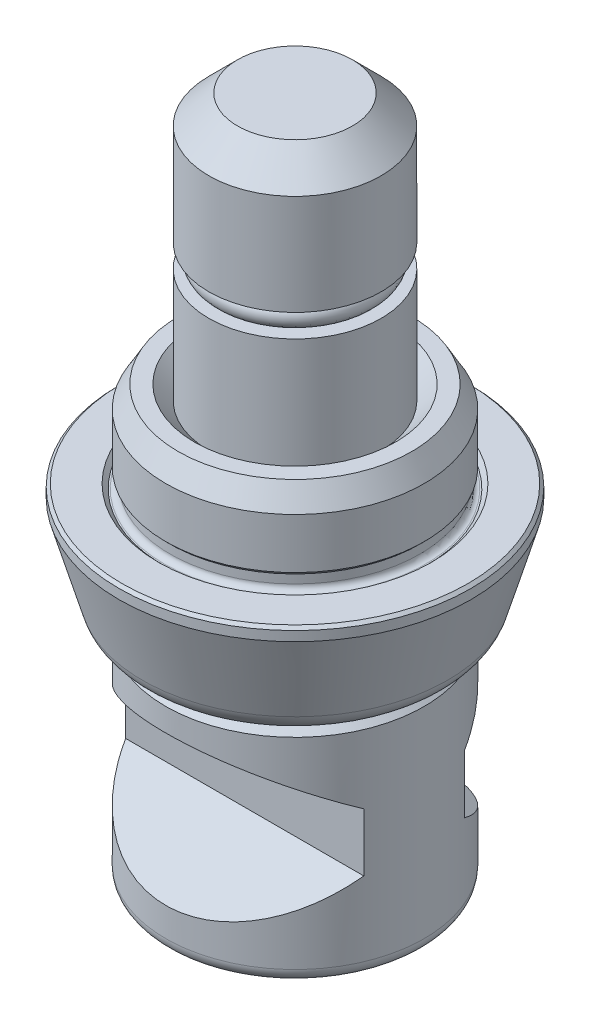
ISO-10303-21;
HEADER;
FILE_DESCRIPTION(('STEP AP214'),'2;1');
FILE_NAME('part.step','',(''),(''),'','','');
FILE_SCHEMA(('AUTOMOTIVE_DESIGN { 1 0 10303 214 1 1 1 1 }'));
ENDSEC;
DATA;
#1=APPLICATION_CONTEXT('core data for automotive mechanical design processes');
#2=APPLICATION_PROTOCOL_DEFINITION('international standard','automotive_design',2000,#1);
#3=PRODUCT_CONTEXT('',#1,'mechanical');
#4=PRODUCT('Part','Part','',(#3));
#5=PRODUCT_RELATED_PRODUCT_CATEGORY('part','',(#4));
#6=PRODUCT_DEFINITION_FORMATION('','',#4);
#7=PRODUCT_DEFINITION_CONTEXT('part definition',#1,'design');
#8=PRODUCT_DEFINITION('design','',#6,#7);
#9=PRODUCT_DEFINITION_SHAPE('','',#8);
#10=(LENGTH_UNIT() NAMED_UNIT(*) SI_UNIT(.MILLI.,.METRE.));
#11=(NAMED_UNIT(*) PLANE_ANGLE_UNIT() SI_UNIT($,.RADIAN.));
#12=(NAMED_UNIT(*) SI_UNIT($,.STERADIAN.) SOLID_ANGLE_UNIT());
#13=UNCERTAINTY_MEASURE_WITH_UNIT(LENGTH_MEASURE(1.E-05),#10,'distance_accuracy_value','');
#14=(GEOMETRIC_REPRESENTATION_CONTEXT(3) GLOBAL_UNCERTAINTY_ASSIGNED_CONTEXT((#13)) GLOBAL_UNIT_ASSIGNED_CONTEXT((#10,
#11,#12)) REPRESENTATION_CONTEXT('',''));
#15=CARTESIAN_POINT('',(0.,0.,0.));
#16=DIRECTION('',(0.,0.,1.));
#17=DIRECTION('',(1.,0.,0.));
#18=AXIS2_PLACEMENT_3D('',#15,#16,#17);
#19=CARTESIAN_POINT('',(-4.05,12.9625,0.));
#20=DIRECTION('',(0.,-1.,0.));
#21=DIRECTION('',(0.,0.,1.));
#22=AXIS2_PLACEMENT_3D('',#19,#20,#21);
#23=PLANE('',#22);
#24=CARTESIAN_POINT('',(0.,12.9625,0.));
#25=DIRECTION('',(0.,-1.,0.));
#26=DIRECTION('',(0.,0.,1.));
#27=AXIS2_PLACEMENT_3D('',#24,#25,#26);
#28=CIRCLE('',#27,6.);
#29=CARTESIAN_POINT('',(0.,12.9625,6.));
#30=VERTEX_POINT('',#29);
#31=EDGE_CURVE('E151',#30,#30,#28,.T.);
#32=ORIENTED_EDGE('',*,*,#31,.F.);
#33=EDGE_LOOP('',(#32));
#34=FACE_BOUND('',#33,.T.);
#35=CARTESIAN_POINT('',(0.,12.9625,0.));
#36=DIRECTION('',(0.,-1.,0.));
#37=DIRECTION('',(0.,0.,-1.));
#38=AXIS2_PLACEMENT_3D('',#35,#36,#37);
#39=CIRCLE('',#38,4.8);
#40=CARTESIAN_POINT('',(0.,12.9625,-4.8));
#41=VERTEX_POINT('',#40);
#42=EDGE_CURVE('E10',#41,#41,#39,.F.);
#43=ORIENTED_EDGE('',*,*,#42,.F.);
#44=EDGE_LOOP('',(#43));
#45=FACE_BOUND('',#44,.T.);
#46=ADVANCED_FACE('F16',(#34,#45),#23,.F.);
#47=CARTESIAN_POINT('',(0.,0.1,0.));
#48=DIRECTION('',(0.,-1.,0.));
#49=DIRECTION('',(0.,0.,-1.));
#50=AXIS2_PLACEMENT_3D('',#47,#48,#49);
#51=TOROIDAL_SURFACE('',#50,9.1,0.4);
#52=CARTESIAN_POINT('',(0.,0.1,0.));
#53=DIRECTION('',(0.,-1.,0.));
#54=DIRECTION('',(0.,0.,-1.));
#55=AXIS2_PLACEMENT_3D('',#52,#53,#54);
#56=CIRCLE('',#55,8.7);
#57=CARTESIAN_POINT('',(0.,0.1,-8.7));
#58=VERTEX_POINT('',#57);
#59=EDGE_CURVE('E661',#58,#58,#56,.F.);
#60=ORIENTED_EDGE('',*,*,#59,.F.);
#61=EDGE_LOOP('',(#60));
#62=FACE_BOUND('',#61,.T.);
#63=CARTESIAN_POINT('',(0.,-0.3,0.));
#64=DIRECTION('',(0.,-1.,0.));
#65=DIRECTION('',(0.,0.,-1.));
#66=AXIS2_PLACEMENT_3D('',#63,#64,#65);
#67=CIRCLE('',#66,9.1);
#68=CARTESIAN_POINT('',(0.,-0.3,-9.1));
#69=VERTEX_POINT('',#68);
#70=EDGE_CURVE('E658',#69,#69,#67,.T.);
#71=ORIENTED_EDGE('',*,*,#70,.F.);
#72=EDGE_LOOP('',(#71));
#73=FACE_BOUND('',#72,.T.);
#74=ADVANCED_FACE('F203',(#62,#73),#51,.F.);
#75=CARTESIAN_POINT('',(0.,1.,0.));
#76=DIRECTION('',(0.,1.,0.));
#77=DIRECTION('',(0.,0.,1.));
#78=AXIS2_PLACEMENT_3D('',#75,#76,#77);
#79=CONICAL_SURFACE('',#78,9.,0.78539816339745);
#80=CARTESIAN_POINT('',(0.,0.7,0.));
#81=DIRECTION('',(0.,-1.,0.));
#82=DIRECTION('',(0.,0.,-1.));
#83=AXIS2_PLACEMENT_3D('',#80,#81,#82);
#84=CIRCLE('',#83,8.7);
#85=CARTESIAN_POINT('',(0.,0.7,-8.7));
#86=VERTEX_POINT('',#85);
#87=EDGE_CURVE('E625',#86,#86,#84,.T.);
#88=ORIENTED_EDGE('',*,*,#87,.F.);
#89=EDGE_LOOP('',(#88));
#90=FACE_BOUND('',#89,.T.);
#91=CARTESIAN_POINT('',(0.,1.,0.));
#92=DIRECTION('',(0.,-1.,0.));
#93=DIRECTION('',(0.,0.,-1.));
#94=AXIS2_PLACEMENT_3D('',#91,#92,#93);
#95=CIRCLE('',#94,9.);
#96=CARTESIAN_POINT('',(0.,1.,-9.));
#97=VERTEX_POINT('',#96);
#98=EDGE_CURVE('E622',#97,#97,#95,.T.);
#99=ORIENTED_EDGE('',*,*,#98,.T.);
#100=EDGE_LOOP('',(#99));
#101=FACE_BOUND('',#100,.T.);
#102=ADVANCED_FACE('F270',(#90,#101),#79,.T.);
#103=CARTESIAN_POINT('',(0.,0.,0.));
#104=DIRECTION('',(0.,-1.,0.));
#105=DIRECTION('',(0.,0.,-1.));
#106=AXIS2_PLACEMENT_3D('',#103,#104,#105);
#107=CYLINDRICAL_SURFACE('',#106,8.7);
#108=ORIENTED_EDGE('',*,*,#59,.T.);
#109=EDGE_LOOP('',(#108));
#110=FACE_BOUND('',#109,.T.);
#111=ORIENTED_EDGE('',*,*,#87,.T.);
#112=EDGE_LOOP('',(#111));
#113=FACE_BOUND('',#112,.T.);
#114=ADVANCED_FACE('F477',(#110,#113),#107,.T.);
#115=CARTESIAN_POINT('',(8.7,-0.3,0.));
#116=DIRECTION('',(0.,-1.,0.));
#117=DIRECTION('',(0.,0.,-1.));
#118=AXIS2_PLACEMENT_3D('',#115,#116,#117);
#119=PLANE('',#118);
#120=ORIENTED_EDGE('',*,*,#70,.T.);
#121=EDGE_LOOP('',(#120));
#122=FACE_BOUND('',#121,.T.);
#123=CARTESIAN_POINT('',(0.,-0.3,0.));
#124=DIRECTION('',(0.,-1.,0.));
#125=DIRECTION('',(0.,0.,-1.));
#126=AXIS2_PLACEMENT_3D('',#123,#124,#125);
#127=CIRCLE('',#126,9.2);
#128=CARTESIAN_POINT('',(0.,-0.3,-9.2));
#129=VERTEX_POINT('',#128);
#130=EDGE_CURVE('E628',#129,#129,#127,.T.);
#131=ORIENTED_EDGE('',*,*,#130,.F.);
#132=EDGE_LOOP('',(#131));
#133=FACE_BOUND('',#132,.T.);
#134=ADVANCED_FACE('F485',(#122,#133),#119,.F.);
#135=CARTESIAN_POINT('',(0.,-0.3,0.));
#136=DIRECTION('',(0.,1.,0.));
#137=DIRECTION('',(0.,0.,1.));
#138=AXIS2_PLACEMENT_3D('',#135,#136,#137);
#139=CONICAL_SURFACE('',#138,9.2,0.785398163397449);
#140=CARTESIAN_POINT('',(0.,0.,0.));
#141=DIRECTION('',(0.,-1.,0.));
#142=DIRECTION('',(0.,0.,-1.));
#143=AXIS2_PLACEMENT_3D('',#140,#141,#142);
#144=CIRCLE('',#143,9.5);
#145=CARTESIAN_POINT('',(0.,0.,-9.5));
#146=VERTEX_POINT('',#145);
#147=EDGE_CURVE('E631',#146,#146,#144,.T.);
#148=ORIENTED_EDGE('',*,*,#147,.F.);
#149=EDGE_LOOP('',(#148));
#150=FACE_BOUND('',#149,.T.);
#151=ORIENTED_EDGE('',*,*,#130,.T.);
#152=EDGE_LOOP('',(#151));
#153=FACE_BOUND('',#152,.T.);
#154=ADVANCED_FACE('F493',(#150,#153),#139,.F.);
#155=CARTESIAN_POINT('',(0.,-0.2,0.));
#156=DIRECTION('',(0.,-1.,0.));
#157=DIRECTION('',(0.,0.,-1.));
#158=AXIS2_PLACEMENT_3D('',#155,#156,#157);
#159=CONICAL_SURFACE('',#158,12.25,0.785398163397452);
#160=CARTESIAN_POINT('',(0.,0.,0.));
#161=DIRECTION('',(0.,1.,0.));
#162=DIRECTION('',(0.,0.,1.));
#163=AXIS2_PLACEMENT_3D('',#160,#161,#162);
#164=CIRCLE('',#163,12.05);
#165=CARTESIAN_POINT('',(0.,0.,12.05));
#166=VERTEX_POINT('',#165);
#167=EDGE_CURVE('E655',#166,#166,#164,.T.);
#168=ORIENTED_EDGE('',*,*,#167,.F.);
#169=EDGE_LOOP('',(#168));
#170=FACE_BOUND('',#169,.T.);
#171=CARTESIAN_POINT('',(0.,-0.2,0.));
#172=DIRECTION('',(0.,1.,0.));
#173=DIRECTION('',(0.,0.,1.));
#174=AXIS2_PLACEMENT_3D('',#171,#172,#173);
#175=CIRCLE('',#174,12.25);
#176=CARTESIAN_POINT('',(0.,-0.2,12.25));
#177=VERTEX_POINT('',#176);
#178=EDGE_CURVE('E652',#177,#177,#175,.F.);
#179=ORIENTED_EDGE('',*,*,#178,.F.);
#180=EDGE_LOOP('',(#179));
#181=FACE_BOUND('',#180,.T.);
#182=ADVANCED_FACE('F501',(#170,#181),#159,.T.);
#183=CARTESIAN_POINT('',(0.,6.,0.));
#184=DIRECTION('',(0.,1.,0.));
#185=DIRECTION('',(0.,0.,1.));
#186=AXIS2_PLACEMENT_3D('',#183,#184,#185);
#187=CONICAL_SURFACE('',#186,7.,0.785398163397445);
#188=CARTESIAN_POINT('',(0.,5.,0.));
#189=DIRECTION('',(0.,1.,0.));
#190=DIRECTION('',(0.,0.,1.));
#191=AXIS2_PLACEMENT_3D('',#188,#189,#190);
#192=CIRCLE('',#191,6.);
#193=CARTESIAN_POINT('',(0.,5.,6.));
#194=VERTEX_POINT('',#193);
#195=EDGE_CURVE('E105',#194,#194,#192,.F.);
#196=ORIENTED_EDGE('',*,*,#195,.T.);
#197=EDGE_LOOP('',(#196));
#198=FACE_BOUND('',#197,.T.);
#199=CARTESIAN_POINT('',(0.,6.,0.));
#200=DIRECTION('',(0.,1.,0.));
#201=DIRECTION('',(0.,0.,1.));
#202=AXIS2_PLACEMENT_3D('',#199,#200,#201);
#203=CIRCLE('',#202,7.);
#204=CARTESIAN_POINT('',(0.,6.,7.));
#205=VERTEX_POINT('',#204);
#206=EDGE_CURVE('E649',#205,#205,#203,.F.);
#207=ORIENTED_EDGE('',*,*,#206,.F.);
#208=EDGE_LOOP('',(#207));
#209=FACE_BOUND('',#208,.T.);
#210=ADVANCED_FACE('F509',(#198,#209),#187,.F.);
#211=CARTESIAN_POINT('',(0.,4.5,0.));
#212=DIRECTION('',(0.,-1.,0.));
#213=DIRECTION('',(0.,0.,-1.));
#214=AXIS2_PLACEMENT_3D('',#211,#212,#213);
#215=CONICAL_SURFACE('',#214,9.,0.523598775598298);
#216=CARTESIAN_POINT('',(0.,6.,0.));
#217=DIRECTION('',(0.,1.,0.));
#218=DIRECTION('',(0.,0.,1.));
#219=AXIS2_PLACEMENT_3D('',#216,#217,#218);
#220=CIRCLE('',#219,8.13397459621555);
#221=CARTESIAN_POINT('',(0.,6.,8.13397459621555));
#222=VERTEX_POINT('',#221);
#223=EDGE_CURVE('E646',#222,#222,#220,.T.);
#224=ORIENTED_EDGE('',*,*,#223,.F.);
#225=EDGE_LOOP('',(#224));
#226=FACE_BOUND('',#225,.T.);
#227=CARTESIAN_POINT('',(0.,4.5,0.));
#228=DIRECTION('',(0.,1.,0.));
#229=DIRECTION('',(0.,0.,1.));
#230=AXIS2_PLACEMENT_3D('',#227,#228,#229);
#231=CIRCLE('',#230,9.);
#232=CARTESIAN_POINT('',(0.,4.5,9.));
#233=VERTEX_POINT('',#232);
#234=EDGE_CURVE('E643',#233,#233,#231,.F.);
#235=ORIENTED_EDGE('',*,*,#234,.F.);
#236=EDGE_LOOP('',(#235));
#237=FACE_BOUND('',#236,.T.);
#238=ADVANCED_FACE('F516',(#226,#237),#215,.T.);
#239=CARTESIAN_POINT('',(0.,-6.,0.));
#240=DIRECTION('',(0.,-1.,0.));
#241=DIRECTION('',(0.,0.,-1.));
#242=AXIS2_PLACEMENT_3D('',#239,#240,#241);
#243=TOROIDAL_SURFACE('',#242,8.69892881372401,2.);
#244=CARTESIAN_POINT('',(0.,-6.55127471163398,0.));
#245=DIRECTION('',(0.,-1.,0.));
#246=DIRECTION('',(0.,0.,-1.));
#247=AXIS2_PLACEMENT_3D('',#244,#245,#246);
#248=CIRCLE('',#247,10.6214522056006);
#249=CARTESIAN_POINT('',(0.,-6.55127471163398,-10.6214522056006));
#250=VERTEX_POINT('',#249);
#251=EDGE_CURVE('E640',#250,#250,#248,.F.);
#252=ORIENTED_EDGE('',*,*,#251,.F.);
#253=EDGE_LOOP('',(#252));
#254=FACE_BOUND('',#253,.T.);
#255=CARTESIAN_POINT('',(0.,-8.,0.));
#256=DIRECTION('',(0.,-1.,0.));
#257=DIRECTION('',(0.,0.,-1.));
#258=AXIS2_PLACEMENT_3D('',#255,#256,#257);
#259=CIRCLE('',#258,8.69892881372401);
#260=CARTESIAN_POINT('',(0.,-8.,-8.69892881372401));
#261=VERTEX_POINT('',#260);
#262=EDGE_CURVE('E637',#261,#261,#259,.T.);
#263=ORIENTED_EDGE('',*,*,#262,.F.);
#264=EDGE_LOOP('',(#263));
#265=FACE_BOUND('',#264,.T.);
#266=ADVANCED_FACE('F524',(#254,#265),#243,.T.);
#267=CARTESIAN_POINT('',(6.,6.,0.));
#268=DIRECTION('',(0.,1.,0.));
#269=DIRECTION('',(0.,0.,1.));
#270=AXIS2_PLACEMENT_3D('',#267,#268,#269);
#271=PLANE('',#270);
#272=ORIENTED_EDGE('',*,*,#206,.T.);
#273=EDGE_LOOP('',(#272));
#274=FACE_BOUND('',#273,.T.);
#275=ORIENTED_EDGE('',*,*,#223,.T.);
#276=EDGE_LOOP('',(#275));
#277=FACE_BOUND('',#276,.T.);
#278=ADVANCED_FACE('F532',(#274,#277),#271,.T.);
#279=CARTESIAN_POINT('',(0.,-8.,0.));
#280=DIRECTION('',(0.,1.,0.));
#281=DIRECTION('',(0.,0.,1.));
#282=AXIS2_PLACEMENT_3D('',#279,#280,#281);
#283=CONICAL_SURFACE('',#282,10.2060369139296,0.279252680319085);
#284=ORIENTED_EDGE('',*,*,#251,.T.);
#285=EDGE_LOOP('',(#284));
#286=FACE_BOUND('',#285,.T.);
#287=CARTESIAN_POINT('',(0.,-0.871853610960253,0.));
#288=DIRECTION('',(0.,-1.,0.));
#289=DIRECTION('',(0.,0.,-1.));
#290=AXIS2_PLACEMENT_3D('',#287,#288,#289);
#291=CIRCLE('',#290,12.25);
#292=CARTESIAN_POINT('',(0.,-0.871853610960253,-12.25));
#293=VERTEX_POINT('',#292);
#294=EDGE_CURVE('E634',#293,#293,#291,.T.);
#295=ORIENTED_EDGE('',*,*,#294,.T.);
#296=EDGE_LOOP('',(#295));
#297=FACE_BOUND('',#296,.T.);
#298=ADVANCED_FACE('F540',(#286,#297),#283,.T.);
#299=CARTESIAN_POINT('',(0.,0.,0.));
#300=DIRECTION('',(0.,-1.,0.));
#301=DIRECTION('',(0.,0.,-1.));
#302=AXIS2_PLACEMENT_3D('',#299,#300,#301);
#303=CYLINDRICAL_SURFACE('',#302,12.25);
#304=ORIENTED_EDGE('',*,*,#178,.T.);
#305=EDGE_LOOP('',(#304));
#306=FACE_BOUND('',#305,.T.);
#307=ORIENTED_EDGE('',*,*,#294,.F.);
#308=EDGE_LOOP('',(#307));
#309=FACE_BOUND('',#308,.T.);
#310=ADVANCED_FACE('F548',(#306,#309),#303,.T.);
#311=CARTESIAN_POINT('',(9.,0.,0.));
#312=DIRECTION('',(0.,1.,0.));
#313=DIRECTION('',(0.,0.,1.));
#314=AXIS2_PLACEMENT_3D('',#311,#312,#313);
#315=PLANE('',#314);
#316=ORIENTED_EDGE('',*,*,#147,.T.);
#317=EDGE_LOOP('',(#316));
#318=FACE_BOUND('',#317,.T.);
#319=ORIENTED_EDGE('',*,*,#167,.T.);
#320=EDGE_LOOP('',(#319));
#321=FACE_BOUND('',#320,.T.);
#322=ADVANCED_FACE('F557',(#318,#321),#315,.T.);
#323=CARTESIAN_POINT('',(0.,0.,0.));
#324=DIRECTION('',(0.,-1.,0.));
#325=DIRECTION('',(0.,0.,-1.));
#326=AXIS2_PLACEMENT_3D('',#323,#324,#325);
#327=CYLINDRICAL_SURFACE('',#326,9.);
#328=ORIENTED_EDGE('',*,*,#98,.F.);
#329=EDGE_LOOP('',(#328));
#330=FACE_BOUND('',#329,.T.);
#331=ORIENTED_EDGE('',*,*,#234,.T.);
#332=EDGE_LOOP('',(#331));
#333=FACE_BOUND('',#332,.T.);
#334=ADVANCED_FACE('F565',(#330,#333),#327,.T.);
#335=CARTESIAN_POINT('',(6.,-8.,0.));
#336=DIRECTION('',(0.,-1.,0.));
#337=DIRECTION('',(0.,0.,-1.));
#338=AXIS2_PLACEMENT_3D('',#335,#336,#337);
#339=PLANE('',#338);
#340=ORIENTED_EDGE('',*,*,#262,.T.);
#341=EDGE_LOOP('',(#340));
#342=FACE_BOUND('',#341,.T.);
#343=CARTESIAN_POINT('',(0.,-8.,0.));
#344=DIRECTION('',(0.,-1.,0.));
#345=DIRECTION('',(0.,0.,-1.));
#346=AXIS2_PLACEMENT_3D('',#343,#344,#345);
#347=CIRCLE('',#346,6.);
#348=CARTESIAN_POINT('',(0.,-8.,-6.));
#349=VERTEX_POINT('',#348);
#350=EDGE_CURVE('E24',#349,#349,#347,.F.);
#351=ORIENTED_EDGE('',*,*,#350,.T.);
#352=EDGE_LOOP('',(#351));
#353=FACE_BOUND('',#352,.T.);
#354=ADVANCED_FACE('F573',(#342,#353),#339,.T.);
#355=CARTESIAN_POINT('',(0.,-8.4375,0.));
#356=DIRECTION('',(0.,-1.,0.));
#357=DIRECTION('',(0.,0.,1.));
#358=AXIS2_PLACEMENT_3D('',#355,#356,#357);
#359=CYLINDRICAL_SURFACE('',#358,6.);
#360=ORIENTED_EDGE('',*,*,#195,.F.);
#361=EDGE_LOOP('',(#360));
#362=FACE_BOUND('',#361,.T.);
#363=ORIENTED_EDGE('',*,*,#31,.T.);
#364=EDGE_LOOP('',(#363));
#365=FACE_BOUND('',#364,.T.);
#366=ADVANCED_FACE('F318',(#362,#365),#359,.T.);
#367=CARTESIAN_POINT('',(0.,-20.4375,0.));
#368=DIRECTION('',(0.,-1.,0.));
#369=DIRECTION('',(0.,0.,1.));
#370=AXIS2_PLACEMENT_3D('',#367,#368,#369);
#371=PLANE('',#370);
#372=DIRECTION('',(0.,0.,1.));
#373=VECTOR('',#372,1.);
#374=CARTESIAN_POINT('',(2.5,-20.4375,-1.44337567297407));
#375=LINE('',#374,#373);
#376=CARTESIAN_POINT('',(2.5,-20.4375,-1.44337567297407));
#377=VERTEX_POINT('',#376);
#378=CARTESIAN_POINT('',(2.5,-20.4375,1.44337567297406));
#379=VERTEX_POINT('',#378);
#380=EDGE_CURVE('E123',#377,#379,#375,.T.);
#381=ORIENTED_EDGE('',*,*,#380,.T.);
#382=DIRECTION('',(-0.866025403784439,0.,0.5));
#383=VECTOR('',#382,1.);
#384=CARTESIAN_POINT('',(2.5,-20.4375,1.44337567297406));
#385=LINE('',#384,#383);
#386=CARTESIAN_POINT('',(0.,-20.4375,2.88675134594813));
#387=VERTEX_POINT('',#386);
#388=EDGE_CURVE('E115',#379,#387,#385,.T.);
#389=ORIENTED_EDGE('',*,*,#388,.T.);
#390=DIRECTION('',(-0.866025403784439,0.,-0.5));
#391=VECTOR('',#390,1.);
#392=CARTESIAN_POINT('',(0.,-20.4375,2.88675134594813));
#393=LINE('',#392,#391);
#394=CARTESIAN_POINT('',(-2.5,-20.4375,1.44337567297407));
#395=VERTEX_POINT('',#394);
#396=EDGE_CURVE('E120',#387,#395,#393,.T.);
#397=ORIENTED_EDGE('',*,*,#396,.T.);
#398=DIRECTION('',(0.,0.,-1.));
#399=VECTOR('',#398,1.);
#400=CARTESIAN_POINT('',(-2.5,-20.4375,1.44337567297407));
#401=LINE('',#400,#399);
#402=CARTESIAN_POINT('',(-2.5,-20.4375,-1.44337567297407));
#403=VERTEX_POINT('',#402);
#404=EDGE_CURVE('E684',#395,#403,#401,.T.);
#405=ORIENTED_EDGE('',*,*,#404,.T.);
#406=DIRECTION('',(0.866025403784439,0.,-0.5));
#407=VECTOR('',#406,1.);
#408=CARTESIAN_POINT('',(-2.5,-20.4375,-1.44337567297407));
#409=LINE('',#408,#407);
#410=CARTESIAN_POINT('',(0.,-20.4375,-2.88675134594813));
#411=VERTEX_POINT('',#410);
#412=EDGE_CURVE('E682',#403,#411,#409,.T.);
#413=ORIENTED_EDGE('',*,*,#412,.T.);
#414=DIRECTION('',(0.866025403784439,0.,0.5));
#415=VECTOR('',#414,1.);
#416=CARTESIAN_POINT('',(0.,-20.4375,-2.88675134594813));
#417=LINE('',#416,#415);
#418=EDGE_CURVE('E128',#411,#377,#417,.T.);
#419=ORIENTED_EDGE('',*,*,#418,.T.);
#420=EDGE_LOOP('',(#381,#389,#397,#405,#413,#419));
#421=FACE_BOUND('',#420,.T.);
#422=ADVANCED_FACE('F205',(#421),#371,.T.);
#423=CARTESIAN_POINT('',(0.,-20.4375,2.88675134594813));
#424=DIRECTION('',(-0.5,0.,0.866025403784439));
#425=DIRECTION('',(0.866025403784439,0.,0.5));
#426=AXIS2_PLACEMENT_3D('',#423,#424,#425);
#427=PLANE('',#426);
#428=CARTESIAN_POINT('',(-2.5002,-23.7567124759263,1.44326020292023));
#429=CARTESIAN_POINT('',(-2.39033676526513,-23.7200764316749,1.50668977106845));
#430=CARTESIAN_POINT('',(-2.27952520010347,-23.6867570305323,1.57066685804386));
#431=CARTESIAN_POINT('',(-2.05598316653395,-23.6285970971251,1.69972891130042));
#432=CARTESIAN_POINT('',(-1.94324872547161,-23.603777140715,1.7648161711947));
#433=CARTESIAN_POINT('',(-1.71917700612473,-23.5651404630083,1.8941840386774));
#434=CARTESIAN_POINT('',(-1.60787420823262,-23.5510666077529,1.95844473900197));
#435=CARTESIAN_POINT('',(-1.38474477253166,-23.53426396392,2.08726857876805));
#436=CARTESIAN_POINT('',(-1.27291894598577,-23.5315212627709,2.15183124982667));
#437=CARTESIAN_POINT('',(-1.06395802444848,-23.5372205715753,2.27247489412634));
#438=CARTESIAN_POINT('',(-0.966791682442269,-23.5442632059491,2.32857390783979));
#439=CARTESIAN_POINT('',(-0.773092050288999,-23.5665862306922,2.44040644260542));
#440=CARTESIAN_POINT('',(-0.676559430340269,-23.5818742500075,2.4961395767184));
#441=CARTESIAN_POINT('',(-0.482460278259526,-23.6200939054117,2.60820277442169));
#442=CARTESIAN_POINT('',(-0.384918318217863,-23.6431875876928,2.66451865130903));
#443=CARTESIAN_POINT('',(-0.191289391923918,-23.6956014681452,2.77631036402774));
#444=CARTESIAN_POINT('',(-0.0951999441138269,-23.7249093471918,2.83178763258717));
#445=CARTESIAN_POINT('',(0.000199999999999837,-23.7567124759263,2.88686681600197));
#446=B_SPLINE_CURVE_WITH_KNOTS('',3,(#428,#429,#430,#431,#432,#433,#434,#435,#436,#437,#438,
#439,#440,#441,#442,#443,#444,#445),.UNSPECIFIED.,.F.,.F.,(4,2,2,2,2,2,2,2,4),(0.,
0.396285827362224,0.79352433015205,1.18093086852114,1.56786160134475,1.90479741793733,
2.24204551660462,2.58677531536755,2.93082800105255),.UNSPECIFIED.);
#447=CARTESIAN_POINT('',(-2.5,-23.7566458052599,1.44337567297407));
#448=VERTEX_POINT('',#447);
#449=CARTESIAN_POINT('',(0.,-23.7566458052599,2.88675134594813));
#450=VERTEX_POINT('',#449);
#451=EDGE_CURVE('E94',#448,#450,#446,.T.);
#452=ORIENTED_EDGE('',*,*,#451,.F.);
#453=DIRECTION('',(0.,-1.,0.));
#454=VECTOR('',#453,1.);
#455=CARTESIAN_POINT('',(-2.5,-20.4375,1.44337567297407));
#456=LINE('',#455,#454);
#457=EDGE_CURVE('E122',#395,#448,#456,.T.);
#458=ORIENTED_EDGE('',*,*,#457,.F.);
#459=ORIENTED_EDGE('',*,*,#396,.F.);
#460=DIRECTION('',(0.,-1.,0.));
#461=VECTOR('',#460,1.);
#462=CARTESIAN_POINT('',(0.,-20.4375,2.88675134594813));
#463=LINE('',#462,#461);
#464=EDGE_CURVE('E112',#387,#450,#463,.T.);
#465=ORIENTED_EDGE('',*,*,#464,.T.);
#466=EDGE_LOOP('',(#452,#458,#459,#465));
#467=FACE_BOUND('',#466,.T.);
#468=ADVANCED_FACE('F118',(#467),#427,.F.);
#469=CARTESIAN_POINT('',(-2.5,-20.4375,1.44337567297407));
#470=DIRECTION('',(-1.,0.,0.));
#471=DIRECTION('',(0.,1.,0.));
#472=AXIS2_PLACEMENT_3D('',#469,#470,#471);
#473=PLANE('',#472);
#474=CARTESIAN_POINT('',(-2.5,-24.9909184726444,-4.35847990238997));
#475=CARTESIAN_POINT('',(-2.5,-24.9387419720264,-4.25428000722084));
#476=CARTESIAN_POINT('',(-2.5,-24.8869226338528,-4.14989938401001));
#477=CARTESIAN_POINT('',(-2.5,-24.7841728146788,-3.94069776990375));
#478=CARTESIAN_POINT('',(-2.5,-24.733242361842,-3.83587676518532));
#479=CARTESIAN_POINT('',(-2.5,-24.6323473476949,-3.62551184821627));
#480=CARTESIAN_POINT('',(-2.5,-24.5823849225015,-3.51996690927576));
#481=CARTESIAN_POINT('',(-2.5,-24.4837694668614,-3.30826399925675));
#482=CARTESIAN_POINT('',(-2.5,-24.4351164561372,-3.2021060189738));
#483=CARTESIAN_POINT('',(-2.5,-24.3372579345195,-2.98423916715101));
#484=CARTESIAN_POINT('',(-2.5,-24.2881271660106,-2.87249661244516));
#485=CARTESIAN_POINT('',(-2.5,-24.1920858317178,-2.64806241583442));
#486=CARTESIAN_POINT('',(-2.5,-24.1451751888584,-2.53537080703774));
#487=CARTESIAN_POINT('',(-2.5,-24.054206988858,-2.3089356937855));
#488=CARTESIAN_POINT('',(-2.5,-24.0101472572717,-2.19519306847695));
#489=CARTESIAN_POINT('',(-2.5,-23.9256215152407,-1.96633759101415));
#490=CARTESIAN_POINT('',(-2.5,-23.8851565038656,-1.85122436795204));
#491=CARTESIAN_POINT('',(-2.5,-23.8000020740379,-1.59257909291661));
#492=CARTESIAN_POINT('',(-2.5,-23.7565084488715,-1.44864606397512));
#493=CARTESIAN_POINT('',(-2.5,-23.6790121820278,-1.15827909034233));
#494=CARTESIAN_POINT('',(-2.5,-23.6450039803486,-1.01184666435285));
#495=CARTESIAN_POINT('',(-2.5,-23.5897899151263,-0.719069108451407));
#496=CARTESIAN_POINT('',(-2.5,-23.5683779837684,-0.572764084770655));
#497=CARTESIAN_POINT('',(-2.5,-23.5398968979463,-0.278772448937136));
#498=CARTESIAN_POINT('',(-2.5,-23.5328215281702,-0.131086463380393));
#499=CARTESIAN_POINT('',(-2.5,-23.5339550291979,0.1651481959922));
#500=CARTESIAN_POINT('',(-2.5,-23.5422596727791,0.313696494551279));
#501=CARTESIAN_POINT('',(-2.5,-23.5732234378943,0.609297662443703));
#502=CARTESIAN_POINT('',(-2.5,-23.5958892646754,0.756349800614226));
#503=CARTESIAN_POINT('',(-2.5,-23.6535393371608,1.05056792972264));
#504=CARTESIAN_POINT('',(-2.5,-23.6887284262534,1.19769251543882));
#505=CARTESIAN_POINT('',(-2.5,-23.768452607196,1.4894187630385));
#506=CARTESIAN_POINT('',(-2.5,-23.8129930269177,1.63401893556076));
#507=CARTESIAN_POINT('',(-2.5,-23.899077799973,1.89132457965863));
#508=CARTESIAN_POINT('',(-2.5,-23.939349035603,2.00446376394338));
#509=CARTESIAN_POINT('',(-2.5,-24.0232846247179,2.22943504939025));
#510=CARTESIAN_POINT('',(-2.5,-24.0669480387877,2.341267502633));
#511=CARTESIAN_POINT('',(-2.5,-24.1569736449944,2.56392567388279));
#512=CARTESIAN_POINT('',(-2.5,-24.2033377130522,2.67475062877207));
#513=CARTESIAN_POINT('',(-2.5,-24.2981795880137,2.89549327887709));
#514=CARTESIAN_POINT('',(-2.5,-24.3466574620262,3.00541094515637));
#515=CARTESIAN_POINT('',(-2.5,-24.4431907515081,3.21980106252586));
#516=CARTESIAN_POINT('',(-2.5,-24.4911756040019,3.3243053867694));
#517=CARTESIAN_POINT('',(-2.5,-24.5884034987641,3.53272405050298));
#518=CARTESIAN_POINT('',(-2.5,-24.637646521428,3.63663839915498));
#519=CARTESIAN_POINT('',(-2.5,-24.7370748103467,3.84378201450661));
#520=CARTESIAN_POINT('',(-2.5,-24.7872582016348,3.94701218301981));
#521=CARTESIAN_POINT('',(-2.5,-24.8884849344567,4.15304668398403));
#522=CARTESIAN_POINT('',(-2.5,-24.9395282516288,4.2558510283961));
#523=CARTESIAN_POINT('',(-2.5,-24.9909184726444,4.35847990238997));
#524=B_SPLINE_CURVE_WITH_KNOTS('',3,(#474,#475,#476,#477,#478,#479,#480,#481,#482,#483,#484,
#485,#486,#487,#488,#489,#490,#491,#492,#493,#494,#495,#496,#497,#498,#499,#500,#501,#502,#503,
#504,#505,#506,#507,#508,#509,#510,#511,#512,#513,#514,#515,#516,#517,#518,#519,#520,#521,#522,
#523),.UNSPECIFIED.,.F.,.F.,(4,2,2,2,2,2,2,2,2,2,2,2,2,2,2,2,2,2,2,2,2,2,2,2,4),(0.,
0.349601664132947,0.699214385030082,1.04952651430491,1.39984391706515,1.7660243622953,
2.13219208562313,2.49807715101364,2.86406358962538,3.3149052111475,3.76548200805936,
4.20846642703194,4.65125875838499,5.0968176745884,5.54258477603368,5.99600640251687,
6.44968706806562,6.80990389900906,7.17002132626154,7.53039195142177,7.8907740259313,
8.23574717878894,8.58071495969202,8.92505583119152,9.26938696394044),.UNSPECIFIED.);
#525=CARTESIAN_POINT('',(-2.5,-23.7566458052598,-1.44337567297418));
#526=VERTEX_POINT('',#525);
#527=EDGE_CURVE('E100',#526,#448,#524,.T.);
#528=ORIENTED_EDGE('',*,*,#527,.F.);
#529=DIRECTION('',(0.,-1.,0.));
#530=VECTOR('',#529,1.);
#531=CARTESIAN_POINT('',(-2.5,-20.4375,-1.44337567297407));
#532=LINE('',#531,#530);
#533=EDGE_CURVE('E125',#403,#526,#532,.T.);
#534=ORIENTED_EDGE('',*,*,#533,.F.);
#535=ORIENTED_EDGE('',*,*,#404,.F.);
#536=ORIENTED_EDGE('',*,*,#457,.T.);
#537=EDGE_LOOP('',(#528,#534,#535,#536));
#538=FACE_BOUND('',#537,.T.);
#539=ADVANCED_FACE('F253',(#538),#473,.F.);
#540=CARTESIAN_POINT('',(-2.5,-20.4375,-1.44337567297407));
#541=DIRECTION('',(-0.5,0.,-0.866025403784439));
#542=DIRECTION('',(-0.866025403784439,0.,0.5));
#543=AXIS2_PLACEMENT_3D('',#540,#541,#542);
#544=PLANE('',#543);
#545=CARTESIAN_POINT('',(0.000199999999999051,-23.7567124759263,-2.88686681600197));
#546=CARTESIAN_POINT('',(-0.109663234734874,-23.7200764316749,-2.82343724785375));
#547=CARTESIAN_POINT('',(-0.220474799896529,-23.6867570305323,-2.75946016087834));
#548=CARTESIAN_POINT('',(-0.444016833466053,-23.6285970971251,-2.63039810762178));
#549=CARTESIAN_POINT('',(-0.556751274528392,-23.603777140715,-2.5653108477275));
#550=CARTESIAN_POINT('',(-0.780822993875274,-23.5651404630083,-2.43594298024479));
#551=CARTESIAN_POINT('',(-0.892125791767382,-23.5510666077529,-2.37168227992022));
#552=CARTESIAN_POINT('',(-1.11525522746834,-23.53426396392,-2.24285844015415));
#553=CARTESIAN_POINT('',(-1.22708105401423,-23.5315212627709,-2.17829576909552));
#554=CARTESIAN_POINT('',(-1.43604197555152,-23.5372205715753,-2.05765212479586));
#555=CARTESIAN_POINT('',(-1.53320831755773,-23.5442632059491,-2.0015531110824));
#556=CARTESIAN_POINT('',(-1.726907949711,-23.5665862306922,-1.88972057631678));
#557=CARTESIAN_POINT('',(-1.82344056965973,-23.5818742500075,-1.8339874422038));
#558=CARTESIAN_POINT('',(-2.01753972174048,-23.6200939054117,-1.7219242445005));
#559=CARTESIAN_POINT('',(-2.11508168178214,-23.6431875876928,-1.66560836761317));
#560=CARTESIAN_POINT('',(-2.30871060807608,-23.6956014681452,-1.55381665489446));
#561=CARTESIAN_POINT('',(-2.40480005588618,-23.7249093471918,-1.49833938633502));
#562=CARTESIAN_POINT('',(-2.5002,-23.7567124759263,-1.44326020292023));
#563=B_SPLINE_CURVE_WITH_KNOTS('',3,(#545,#546,#547,#548,#549,#550,#551,#552,#553,#554,#555,
#556,#557,#558,#559,#560,#561,#562),.UNSPECIFIED.,.F.,.F.,(4,2,2,2,2,2,2,2,4),(0.,
0.396285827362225,0.793524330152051,1.18093086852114,1.56786160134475,1.90479741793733,
2.24204551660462,2.58677531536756,2.93082800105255),.UNSPECIFIED.);
#564=CARTESIAN_POINT('',(0.,-23.7566458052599,-2.88675134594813));
#565=VERTEX_POINT('',#564);
#566=EDGE_CURVE('E219',#565,#526,#563,.T.);
#567=ORIENTED_EDGE('',*,*,#566,.F.);
#568=DIRECTION('',(0.,-1.,0.));
#569=VECTOR('',#568,1.);
#570=CARTESIAN_POINT('',(0.,-20.4375,-2.88675134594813));
#571=LINE('',#570,#569);
#572=EDGE_CURVE('E672',#411,#565,#571,.T.);
#573=ORIENTED_EDGE('',*,*,#572,.F.);
#574=ORIENTED_EDGE('',*,*,#412,.F.);
#575=ORIENTED_EDGE('',*,*,#533,.T.);
#576=EDGE_LOOP('',(#567,#573,#574,#575));
#577=FACE_BOUND('',#576,.T.);
#578=ADVANCED_FACE('F249',(#577),#544,.F.);
#579=CARTESIAN_POINT('',(0.,-20.4375,-2.88675134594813));
#580=DIRECTION('',(0.5,0.,-0.866025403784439));
#581=DIRECTION('',(-0.866025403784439,0.,-0.5));
#582=AXIS2_PLACEMENT_3D('',#579,#580,#581);
#583=PLANE('',#582);
#584=CARTESIAN_POINT('',(2.5002,-23.7567124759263,-1.44326020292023));
#585=CARTESIAN_POINT('',(2.39033676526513,-23.7200764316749,-1.50668977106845));
#586=CARTESIAN_POINT('',(2.27952520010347,-23.6867570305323,-1.57066685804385));
#587=CARTESIAN_POINT('',(2.05598316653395,-23.6285970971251,-1.69972891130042));
#588=CARTESIAN_POINT('',(1.94324872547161,-23.603777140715,-1.7648161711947));
#589=CARTESIAN_POINT('',(1.71917700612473,-23.5651404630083,-1.8941840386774));
#590=CARTESIAN_POINT('',(1.60787420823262,-23.5510666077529,-1.95844473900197));
#591=CARTESIAN_POINT('',(1.38474477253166,-23.53426396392,-2.08726857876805));
#592=CARTESIAN_POINT('',(1.27291894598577,-23.5315212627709,-2.15183124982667));
#593=CARTESIAN_POINT('',(1.06395802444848,-23.5372205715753,-2.27247489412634));
#594=CARTESIAN_POINT('',(0.966791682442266,-23.5442632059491,-2.3285739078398));
#595=CARTESIAN_POINT('',(0.773092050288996,-23.5665862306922,-2.44040644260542));
#596=CARTESIAN_POINT('',(0.676559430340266,-23.5818742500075,-2.4961395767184));
#597=CARTESIAN_POINT('',(0.482460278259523,-23.6200939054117,-2.60820277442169));
#598=CARTESIAN_POINT('',(0.384918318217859,-23.6431875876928,-2.66451865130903));
#599=CARTESIAN_POINT('',(0.191289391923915,-23.6956014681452,-2.77631036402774));
#600=CARTESIAN_POINT('',(0.0951999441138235,-23.7249093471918,-2.83178763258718));
#601=CARTESIAN_POINT('',(-0.000200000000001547,-23.7567124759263,-2.88686681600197));
#602=B_SPLINE_CURVE_WITH_KNOTS('',3,(#584,#585,#586,#587,#588,#589,#590,#591,#592,#593,#594,
#595,#596,#597,#598,#599,#600,#601),.UNSPECIFIED.,.F.,.F.,(4,2,2,2,2,2,2,2,4),(0.,
0.396285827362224,0.793524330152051,1.18093086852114,1.56786160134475,1.90479741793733,
2.24204551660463,2.58677531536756,2.93082800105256),.UNSPECIFIED.);
#603=CARTESIAN_POINT('',(2.5,-23.7566458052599,-1.44337567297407));
#604=VERTEX_POINT('',#603);
#605=EDGE_CURVE('E226',#604,#565,#602,.T.);
#606=ORIENTED_EDGE('',*,*,#605,.F.);
#607=DIRECTION('',(0.,-1.,0.));
#608=VECTOR('',#607,1.);
#609=CARTESIAN_POINT('',(2.5,-20.4375,-1.44337567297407));
#610=LINE('',#609,#608);
#611=EDGE_CURVE('E676',#377,#604,#610,.T.);
#612=ORIENTED_EDGE('',*,*,#611,.F.);
#613=ORIENTED_EDGE('',*,*,#418,.F.);
#614=ORIENTED_EDGE('',*,*,#572,.T.);
#615=EDGE_LOOP('',(#606,#612,#613,#614));
#616=FACE_BOUND('',#615,.T.);
#617=ADVANCED_FACE('F245',(#616),#583,.F.);
#618=CARTESIAN_POINT('',(2.5,-20.4375,-1.44337567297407));
#619=DIRECTION('',(1.,0.,0.));
#620=DIRECTION('',(0.,-1.,0.));
#621=AXIS2_PLACEMENT_3D('',#618,#619,#620);
#622=PLANE('',#621);
#623=CARTESIAN_POINT('',(2.5,-24.9909184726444,4.35847990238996));
#624=CARTESIAN_POINT('',(2.5,-24.9387419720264,4.25428000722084));
#625=CARTESIAN_POINT('',(2.5,-24.8869226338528,4.14989938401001));
#626=CARTESIAN_POINT('',(2.5,-24.7841728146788,3.94069776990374));
#627=CARTESIAN_POINT('',(2.5,-24.733242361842,3.83587676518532));
#628=CARTESIAN_POINT('',(2.5,-24.6323473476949,3.62551184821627));
#629=CARTESIAN_POINT('',(2.5,-24.5823849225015,3.51996690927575));
#630=CARTESIAN_POINT('',(2.5,-24.4837694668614,3.30826399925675));
#631=CARTESIAN_POINT('',(2.5,-24.4351164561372,3.20210601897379));
#632=CARTESIAN_POINT('',(2.5,-24.3372579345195,2.984239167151));
#633=CARTESIAN_POINT('',(2.5,-24.2881271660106,2.87249661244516));
#634=CARTESIAN_POINT('',(2.5,-24.1920858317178,2.64806241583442));
#635=CARTESIAN_POINT('',(2.5,-24.1451751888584,2.53537080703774));
#636=CARTESIAN_POINT('',(2.5,-24.054206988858,2.3089356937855));
#637=CARTESIAN_POINT('',(2.5,-24.0101472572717,2.19519306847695));
#638=CARTESIAN_POINT('',(2.5,-23.9256215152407,1.96633759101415));
#639=CARTESIAN_POINT('',(2.5,-23.8851565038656,1.85122436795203));
#640=CARTESIAN_POINT('',(2.5,-23.8000020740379,1.59257909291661));
#641=CARTESIAN_POINT('',(2.5,-23.7565084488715,1.44864606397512));
#642=CARTESIAN_POINT('',(2.5,-23.6790121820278,1.15827909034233));
#643=CARTESIAN_POINT('',(2.5,-23.6450039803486,1.01184666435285));
#644=CARTESIAN_POINT('',(2.5,-23.5897899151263,0.719069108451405));
#645=CARTESIAN_POINT('',(2.5,-23.5683779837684,0.572764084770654));
#646=CARTESIAN_POINT('',(2.5,-23.5398968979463,0.278772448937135));
#647=CARTESIAN_POINT('',(2.5,-23.5328215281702,0.131086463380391));
#648=CARTESIAN_POINT('',(2.5,-23.5339550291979,-0.165148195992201));
#649=CARTESIAN_POINT('',(2.5,-23.5422596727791,-0.313696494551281));
#650=CARTESIAN_POINT('',(2.5,-23.5732234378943,-0.609297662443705));
#651=CARTESIAN_POINT('',(2.5,-23.5958892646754,-0.756349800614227));
#652=CARTESIAN_POINT('',(2.5,-23.6535393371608,-1.05056792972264));
#653=CARTESIAN_POINT('',(2.5,-23.6887284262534,-1.19769251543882));
#654=CARTESIAN_POINT('',(2.5,-23.768452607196,-1.48941876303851));
#655=CARTESIAN_POINT('',(2.5,-23.8129930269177,-1.63401893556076));
#656=CARTESIAN_POINT('',(2.5,-23.899077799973,-1.89132457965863));
#657=CARTESIAN_POINT('',(2.5,-23.939349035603,-2.00446376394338));
#658=CARTESIAN_POINT('',(2.5,-24.0232846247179,-2.22943504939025));
#659=CARTESIAN_POINT('',(2.5,-24.0669480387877,-2.341267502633));
#660=CARTESIAN_POINT('',(2.5,-24.1569736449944,-2.56392567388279));
#661=CARTESIAN_POINT('',(2.5,-24.2033377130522,-2.67475062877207));
#662=CARTESIAN_POINT('',(2.5,-24.2981795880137,-2.89549327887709));
#663=CARTESIAN_POINT('',(2.5,-24.3466574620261,-3.00541094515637));
#664=CARTESIAN_POINT('',(2.5,-24.4431907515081,-3.21980106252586));
#665=CARTESIAN_POINT('',(2.5,-24.4911756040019,-3.3243053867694));
#666=CARTESIAN_POINT('',(2.5,-24.5884034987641,-3.53272405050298));
#667=CARTESIAN_POINT('',(2.5,-24.637646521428,-3.63663839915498));
#668=CARTESIAN_POINT('',(2.5,-24.7370748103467,-3.84378201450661));
#669=CARTESIAN_POINT('',(2.5,-24.7872582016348,-3.94701218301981));
#670=CARTESIAN_POINT('',(2.5,-24.8884849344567,-4.15304668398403));
#671=CARTESIAN_POINT('',(2.5,-24.9395282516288,-4.2558510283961));
#672=CARTESIAN_POINT('',(2.5,-24.9909184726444,-4.35847990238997));
#673=B_SPLINE_CURVE_WITH_KNOTS('',3,(#623,#624,#625,#626,#627,#628,#629,#630,#631,#632,#633,
#634,#635,#636,#637,#638,#639,#640,#641,#642,#643,#644,#645,#646,#647,#648,#649,#650,#651,#652,
#653,#654,#655,#656,#657,#658,#659,#660,#661,#662,#663,#664,#665,#666,#667,#668,#669,#670,#671,
#672),.UNSPECIFIED.,.F.,.F.,(4,2,2,2,2,2,2,2,2,2,2,2,2,2,2,2,2,2,2,2,2,2,2,2,4),(0.,
0.349601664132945,0.699214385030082,1.04952651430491,1.39984391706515,1.7660243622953,
2.13219208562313,2.49807715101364,2.86406358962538,3.3149052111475,3.76548200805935,
4.20846642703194,4.65125875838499,5.0968176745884,5.54258477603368,5.99600640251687,
6.44968706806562,6.80990389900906,7.17002132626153,7.53039195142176,7.8907740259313,
8.23574717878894,8.58071495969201,8.92505583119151,9.26938696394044),.UNSPECIFIED.);
#674=CARTESIAN_POINT('',(2.5,-23.7566458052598,1.44337567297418));
#675=VERTEX_POINT('',#674);
#676=EDGE_CURVE('E116',#675,#604,#673,.T.);
#677=ORIENTED_EDGE('',*,*,#676,.F.);
#678=DIRECTION('',(0.,-1.,0.));
#679=VECTOR('',#678,1.);
#680=CARTESIAN_POINT('',(2.5,-20.4375,1.44337567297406));
#681=LINE('',#680,#679);
#682=EDGE_CURVE('E114',#379,#675,#681,.T.);
#683=ORIENTED_EDGE('',*,*,#682,.F.);
#684=ORIENTED_EDGE('',*,*,#380,.F.);
#685=ORIENTED_EDGE('',*,*,#611,.T.);
#686=EDGE_LOOP('',(#677,#683,#684,#685));
#687=FACE_BOUND('',#686,.T.);
#688=ADVANCED_FACE('F242',(#687),#622,.F.);
#689=CARTESIAN_POINT('',(2.5,-20.4375,1.44337567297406));
#690=DIRECTION('',(0.5,0.,0.866025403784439));
#691=DIRECTION('',(0.866025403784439,0.,-0.5));
#692=AXIS2_PLACEMENT_3D('',#689,#690,#691);
#693=PLANE('',#692);
#694=CARTESIAN_POINT('',(-0.000200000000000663,-23.7567124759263,2.88686681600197));
#695=CARTESIAN_POINT('',(0.109663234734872,-23.7200764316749,2.82343724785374));
#696=CARTESIAN_POINT('',(0.220474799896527,-23.6867570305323,2.75946016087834));
#697=CARTESIAN_POINT('',(0.444016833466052,-23.6285970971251,2.63039810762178));
#698=CARTESIAN_POINT('',(0.556751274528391,-23.603777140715,2.56531084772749));
#699=CARTESIAN_POINT('',(0.780822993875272,-23.5651404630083,2.43594298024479));
#700=CARTESIAN_POINT('',(0.89212579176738,-23.5510666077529,2.37168227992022));
#701=CARTESIAN_POINT('',(1.11525522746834,-23.53426396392,2.24285844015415));
#702=CARTESIAN_POINT('',(1.22708105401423,-23.5315212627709,2.17829576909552));
#703=CARTESIAN_POINT('',(1.43604197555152,-23.5372205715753,2.05765212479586));
#704=CARTESIAN_POINT('',(1.53320831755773,-23.5442632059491,2.0015531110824));
#705=CARTESIAN_POINT('',(1.726907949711,-23.5665862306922,1.88972057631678));
#706=CARTESIAN_POINT('',(1.82344056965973,-23.5818742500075,1.8339874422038));
#707=CARTESIAN_POINT('',(2.01753972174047,-23.6200939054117,1.7219242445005));
#708=CARTESIAN_POINT('',(2.11508168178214,-23.6431875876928,1.66560836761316));
#709=CARTESIAN_POINT('',(2.30871060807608,-23.6956014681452,1.55381665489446));
#710=CARTESIAN_POINT('',(2.40480005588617,-23.7249093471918,1.49833938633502));
#711=CARTESIAN_POINT('',(2.5002,-23.7567124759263,1.44326020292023));
#712=B_SPLINE_CURVE_WITH_KNOTS('',3,(#694,#695,#696,#697,#698,#699,#700,#701,#702,#703,#704,
#705,#706,#707,#708,#709,#710,#711),.UNSPECIFIED.,.F.,.F.,(4,2,2,2,2,2,2,2,4),(0.,
0.396285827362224,0.793524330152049,1.18093086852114,1.56786160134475,1.90479741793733,
2.24204551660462,2.58677531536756,2.93082800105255),.UNSPECIFIED.);
#713=EDGE_CURVE('E97',#450,#675,#712,.T.);
#714=ORIENTED_EDGE('',*,*,#713,.F.);
#715=ORIENTED_EDGE('',*,*,#464,.F.);
#716=ORIENTED_EDGE('',*,*,#388,.F.);
#717=ORIENTED_EDGE('',*,*,#682,.T.);
#718=EDGE_LOOP('',(#714,#715,#716,#717));
#719=FACE_BOUND('',#718,.T.);
#720=ADVANCED_FACE('F111',(#719),#693,.F.);
#721=CARTESIAN_POINT('',(0.,-23.9375,0.));
#722=DIRECTION('',(0.,-1.,0.));
#723=DIRECTION('',(0.,0.,1.));
#724=AXIS2_PLACEMENT_3D('',#721,#722,#723);
#725=CONICAL_SURFACE('',#724,3.2,1.0471975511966);
#726=CARTESIAN_POINT('',(0.,-23.9375,0.));
#727=DIRECTION('',(0.,1.,0.));
#728=DIRECTION('',(0.,0.,-1.));
#729=AXIS2_PLACEMENT_3D('',#726,#727,#728);
#730=CIRCLE('',#729,3.2);
#731=CARTESIAN_POINT('',(0.,-23.9375,-3.2));
#732=VERTEX_POINT('',#731);
#733=EDGE_CURVE('E663',#732,#732,#730,.T.);
#734=ORIENTED_EDGE('',*,*,#733,.F.);
#735=EDGE_LOOP('',(#734));
#736=FACE_BOUND('',#735,.T.);
#737=ORIENTED_EDGE('',*,*,#713,.T.);
#738=ORIENTED_EDGE('',*,*,#676,.T.);
#739=ORIENTED_EDGE('',*,*,#605,.T.);
#740=ORIENTED_EDGE('',*,*,#566,.T.);
#741=ORIENTED_EDGE('',*,*,#527,.T.);
#742=ORIENTED_EDGE('',*,*,#451,.T.);
#743=EDGE_LOOP('',(#737,#738,#739,#740,#741,#742));
#744=FACE_BOUND('',#743,.T.);
#745=ADVANCED_FACE('F96',(#736,#744),#725,.F.);
#746=CARTESIAN_POINT('',(9.,-23.9375,0.));
#747=DIRECTION('',(0.,-1.,0.));
#748=DIRECTION('',(-1.,0.,0.));
#749=AXIS2_PLACEMENT_3D('',#746,#747,#748);
#750=PLANE('',#749);
#751=ORIENTED_EDGE('',*,*,#733,.T.);
#752=EDGE_LOOP('',(#751));
#753=FACE_BOUND('',#752,.T.);
#754=CARTESIAN_POINT('',(0.,-23.9375,0.));
#755=DIRECTION('',(0.,-1.,0.));
#756=DIRECTION('',(-1.,0.,0.));
#757=AXIS2_PLACEMENT_3D('',#754,#755,#756);
#758=CIRCLE('',#757,8.);
#759=CARTESIAN_POINT('',(-8.,-23.9375,0.));
#760=VERTEX_POINT('',#759);
#761=EDGE_CURVE('E181',#760,#760,#758,.T.);
#762=ORIENTED_EDGE('',*,*,#761,.T.);
#763=EDGE_LOOP('',(#762));
#764=FACE_BOUND('',#763,.T.);
#765=ADVANCED_FACE('F201',(#753,#764),#750,.T.);
#766=CARTESIAN_POINT('',(15.,-17.7620735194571,3.5));
#767=DIRECTION('',(0.,-0.866025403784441,-0.5));
#768=DIRECTION('',(0.,-0.5,0.866025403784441));
#769=AXIS2_PLACEMENT_3D('',#766,#767,#768);
#770=PLANE('',#769);
#771=DIRECTION('',(-1.,0.,0.));
#772=VECTOR('',#771,1.);
#773=CARTESIAN_POINT('',(15.,-17.7620735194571,3.5));
#774=LINE('',#773,#772);
#775=CARTESIAN_POINT('',(8.2915619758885,-17.7620735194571,3.5));
#776=VERTEX_POINT('',#775);
#777=CARTESIAN_POINT('',(-8.2915619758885,-17.7620735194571,3.5));
#778=VERTEX_POINT('',#777);
#779=EDGE_CURVE('E157',#776,#778,#774,.T.);
#780=ORIENTED_EDGE('',*,*,#779,.T.);
#781=CARTESIAN_POINT('',(0.,-15.7413475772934,0.));
#782=DIRECTION('',(0.,-0.866025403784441,-0.5));
#783=DIRECTION('',(0.,0.5,-0.866025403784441));
#784=AXIS2_PLACEMENT_3D('',#781,#782,#783);
#785=ELLIPSE('',#784,10.3923048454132,9.);
#786=EDGE_CURVE('E138',#776,#778,#785,.T.);
#787=ORIENTED_EDGE('',*,*,#786,.F.);
#788=EDGE_LOOP('',(#780,#787));
#789=FACE_BOUND('',#788,.T.);
#790=ADVANCED_FACE('F301',(#789),#770,.F.);
#791=CARTESIAN_POINT('',(15.,-13.7129264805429,3.5));
#792=DIRECTION('',(0.,0.,-1.));
#793=DIRECTION('',(0.,-1.,0.));
#794=AXIS2_PLACEMENT_3D('',#791,#792,#793);
#795=PLANE('',#794);
#796=DIRECTION('',(0.,1.,0.));
#797=VECTOR('',#796,1.);
#798=CARTESIAN_POINT('',(-8.2915619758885,-22.0625,3.5));
#799=LINE('',#798,#797);
#800=CARTESIAN_POINT('',(-8.2915619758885,-13.7129264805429,3.5));
#801=VERTEX_POINT('',#800);
#802=EDGE_CURVE('E141',#778,#801,#799,.T.);
#803=ORIENTED_EDGE('',*,*,#802,.F.);
#804=ORIENTED_EDGE('',*,*,#779,.F.);
#805=DIRECTION('',(0.,1.,0.));
#806=VECTOR('',#805,1.);
#807=CARTESIAN_POINT('',(8.2915619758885,-22.0625,3.5));
#808=LINE('',#807,#806);
#809=CARTESIAN_POINT('',(8.2915619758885,-13.7129264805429,3.5));
#810=VERTEX_POINT('',#809);
#811=EDGE_CURVE('E31',#810,#776,#808,.F.);
#812=ORIENTED_EDGE('',*,*,#811,.F.);
#813=DIRECTION('',(-1.,0.,0.));
#814=VECTOR('',#813,1.);
#815=CARTESIAN_POINT('',(15.,-13.7129264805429,3.5));
#816=LINE('',#815,#814);
#817=EDGE_CURVE('E160',#810,#801,#816,.T.);
#818=ORIENTED_EDGE('',*,*,#817,.T.);
#819=EDGE_LOOP('',(#803,#804,#812,#818));
#820=FACE_BOUND('',#819,.T.);
#821=ADVANCED_FACE('F299',(#820),#795,.F.);
#822=CARTESIAN_POINT('',(15.,-10.2488248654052,9.5));
#823=DIRECTION('',(0.,0.86602540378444,-0.5));
#824=DIRECTION('',(0.,-0.5,-0.866025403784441));
#825=AXIS2_PLACEMENT_3D('',#822,#823,#824);
#826=PLANE('',#825);
#827=CARTESIAN_POINT('',(0.,-15.7336524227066,0.));
#828=DIRECTION('',(0.,0.86602540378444,-0.5));
#829=DIRECTION('',(0.,0.5,0.866025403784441));
#830=AXIS2_PLACEMENT_3D('',#827,#828,#829);
#831=ELLIPSE('',#830,10.3923048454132,9.);
#832=EDGE_CURVE('E143',#801,#810,#831,.T.);
#833=ORIENTED_EDGE('',*,*,#832,.F.);
#834=ORIENTED_EDGE('',*,*,#817,.F.);
#835=EDGE_LOOP('',(#833,#834));
#836=FACE_BOUND('',#835,.T.);
#837=ADVANCED_FACE('F287',(#836),#826,.F.);
#838=CARTESIAN_POINT('',(15.,-17.7620735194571,-3.5));
#839=DIRECTION('',(0.,0.866025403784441,-0.5));
#840=DIRECTION('',(0.,-0.5,-0.866025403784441));
#841=AXIS2_PLACEMENT_3D('',#838,#839,#840);
#842=PLANE('',#841);
#843=CARTESIAN_POINT('',(0.,-15.7413475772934,0.));
#844=DIRECTION('',(0.,0.866025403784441,-0.5));
#845=DIRECTION('',(0.,0.5,0.866025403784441));
#846=AXIS2_PLACEMENT_3D('',#843,#844,#845);
#847=ELLIPSE('',#846,10.3923048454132,9.);
#848=CARTESIAN_POINT('',(8.2915619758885,-17.7620735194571,-3.5));
#849=VERTEX_POINT('',#848);
#850=CARTESIAN_POINT('',(-8.2915619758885,-17.7620735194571,-3.5));
#851=VERTEX_POINT('',#850);
#852=EDGE_CURVE('E135',#849,#851,#847,.T.);
#853=ORIENTED_EDGE('',*,*,#852,.T.);
#854=DIRECTION('',(-1.,0.,0.));
#855=VECTOR('',#854,1.);
#856=CARTESIAN_POINT('',(15.,-17.7620735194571,-3.5));
#857=LINE('',#856,#855);
#858=EDGE_CURVE('E155',#849,#851,#857,.T.);
#859=ORIENTED_EDGE('',*,*,#858,.F.);
#860=EDGE_LOOP('',(#853,#859));
#861=FACE_BOUND('',#860,.T.);
#862=ADVANCED_FACE('F283',(#861),#842,.T.);
#863=CARTESIAN_POINT('',(15.,-10.2488248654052,-9.5));
#864=DIRECTION('',(0.,-0.86602540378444,-0.5));
#865=DIRECTION('',(0.,-0.5,0.866025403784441));
#866=AXIS2_PLACEMENT_3D('',#863,#864,#865);
#867=PLANE('',#866);
#868=DIRECTION('',(-1.,0.,0.));
#869=VECTOR('',#868,1.);
#870=CARTESIAN_POINT('',(15.,-13.7129264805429,-3.5));
#871=LINE('',#870,#869);
#872=CARTESIAN_POINT('',(8.2915619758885,-13.7129264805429,-3.5));
#873=VERTEX_POINT('',#872);
#874=CARTESIAN_POINT('',(-8.2915619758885,-13.7129264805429,-3.5));
#875=VERTEX_POINT('',#874);
#876=EDGE_CURVE('E154',#873,#875,#871,.T.);
#877=ORIENTED_EDGE('',*,*,#876,.T.);
#878=CARTESIAN_POINT('',(0.,-15.7336524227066,0.));
#879=DIRECTION('',(0.,-0.86602540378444,-0.5));
#880=DIRECTION('',(0.,0.5,-0.866025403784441));
#881=AXIS2_PLACEMENT_3D('',#878,#879,#880);
#882=ELLIPSE('',#881,10.3923048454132,9.);
#883=EDGE_CURVE('E176',#875,#873,#882,.T.);
#884=ORIENTED_EDGE('',*,*,#883,.T.);
#885=EDGE_LOOP('',(#877,#884));
#886=FACE_BOUND('',#885,.T.);
#887=ADVANCED_FACE('F286',(#886),#867,.T.);
#888=CARTESIAN_POINT('',(15.,-13.7129264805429,-3.5));
#889=DIRECTION('',(0.,0.,-1.));
#890=DIRECTION('',(0.,-1.,0.));
#891=AXIS2_PLACEMENT_3D('',#888,#889,#890);
#892=PLANE('',#891);
#893=ORIENTED_EDGE('',*,*,#858,.T.);
#894=DIRECTION('',(0.,1.,0.));
#895=VECTOR('',#894,1.);
#896=CARTESIAN_POINT('',(-8.2915619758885,-22.0625,-3.5));
#897=LINE('',#896,#895);
#898=EDGE_CURVE('E133',#851,#875,#897,.T.);
#899=ORIENTED_EDGE('',*,*,#898,.T.);
#900=ORIENTED_EDGE('',*,*,#876,.F.);
#901=DIRECTION('',(0.,1.,0.));
#902=VECTOR('',#901,1.);
#903=CARTESIAN_POINT('',(8.2915619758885,-22.0625,-3.5));
#904=LINE('',#903,#902);
#905=EDGE_CURVE('E39',#873,#849,#904,.F.);
#906=ORIENTED_EDGE('',*,*,#905,.T.);
#907=EDGE_LOOP('',(#893,#899,#900,#906));
#908=FACE_BOUND('',#907,.T.);
#909=ADVANCED_FACE('F291',(#908),#892,.T.);
#910=CARTESIAN_POINT('',(0.,-22.9375,0.));
#911=DIRECTION('',(0.,-1.,0.));
#912=DIRECTION('',(-1.,0.,0.));
#913=AXIS2_PLACEMENT_3D('',#910,#911,#912);
#914=TOROIDAL_SURFACE('',#913,8.,1.);
#915=ORIENTED_EDGE('',*,*,#761,.F.);
#916=EDGE_LOOP('',(#915));
#917=FACE_BOUND('',#916,.T.);
#918=CARTESIAN_POINT('',(0.,-22.9375,0.));
#919=DIRECTION('',(0.,-1.,0.));
#920=DIRECTION('',(-1.,0.,0.));
#921=AXIS2_PLACEMENT_3D('',#918,#919,#920);
#922=CIRCLE('',#921,9.);
#923=CARTESIAN_POINT('',(-9.,-22.9375,0.));
#924=VERTEX_POINT('',#923);
#925=EDGE_CURVE('E178',#924,#924,#922,.F.);
#926=ORIENTED_EDGE('',*,*,#925,.F.);
#927=EDGE_LOOP('',(#926));
#928=FACE_BOUND('',#927,.T.);
#929=ADVANCED_FACE('F295',(#917,#928),#914,.T.);
#930=CARTESIAN_POINT('',(0.,-22.0625,0.));
#931=DIRECTION('',(0.,1.,0.));
#932=DIRECTION('',(0.,0.,-1.));
#933=AXIS2_PLACEMENT_3D('',#930,#931,#932);
#934=CYLINDRICAL_SURFACE('',#933,9.);
#935=CARTESIAN_POINT('',(0.,-8.9375,0.));
#936=DIRECTION('',(0.,1.,0.));
#937=DIRECTION('',(0.,0.,-1.));
#938=AXIS2_PLACEMENT_3D('',#935,#936,#937);
#939=CIRCLE('',#938,9.);
#940=CARTESIAN_POINT('',(0.,-8.9375,-9.));
#941=VERTEX_POINT('',#940);
#942=EDGE_CURVE('E106',#941,#941,#939,.F.);
#943=ORIENTED_EDGE('',*,*,#942,.T.);
#944=EDGE_LOOP('',(#943));
#945=FACE_BOUND('',#944,.T.);
#946=ORIENTED_EDGE('',*,*,#925,.T.);
#947=EDGE_LOOP('',(#946));
#948=FACE_BOUND('',#947,.T.);
#949=ORIENTED_EDGE('',*,*,#905,.F.);
#950=ORIENTED_EDGE('',*,*,#883,.F.);
#951=ORIENTED_EDGE('',*,*,#898,.F.);
#952=ORIENTED_EDGE('',*,*,#852,.F.);
#953=EDGE_LOOP('',(#949,#950,#951,#952));
#954=FACE_BOUND('',#953,.T.);
#955=ORIENTED_EDGE('',*,*,#832,.T.);
#956=ORIENTED_EDGE('',*,*,#811,.T.);
#957=ORIENTED_EDGE('',*,*,#786,.T.);
#958=ORIENTED_EDGE('',*,*,#802,.T.);
#959=EDGE_LOOP('',(#955,#956,#957,#958));
#960=FACE_BOUND('',#959,.T.);
#961=ADVANCED_FACE('F331',(#945,#948,#954,#960),#934,.T.);
#962=CARTESIAN_POINT('',(0.,-8.4375,0.));
#963=DIRECTION('',(0.,-1.,0.));
#964=DIRECTION('',(0.,0.,1.));
#965=AXIS2_PLACEMENT_3D('',#962,#963,#964);
#966=CONICAL_SURFACE('',#965,8.5,0.785398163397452);
#967=ORIENTED_EDGE('',*,*,#942,.F.);
#968=EDGE_LOOP('',(#967));
#969=FACE_BOUND('',#968,.T.);
#970=CARTESIAN_POINT('',(0.,-8.4375,0.));
#971=DIRECTION('',(0.,1.,0.));
#972=DIRECTION('',(0.,0.,-1.));
#973=AXIS2_PLACEMENT_3D('',#970,#971,#972);
#974=CIRCLE('',#973,8.5);
#975=CARTESIAN_POINT('',(0.,-8.4375,-8.5));
#976=VERTEX_POINT('',#975);
#977=EDGE_CURVE('E184',#976,#976,#974,.T.);
#978=ORIENTED_EDGE('',*,*,#977,.F.);
#979=EDGE_LOOP('',(#978));
#980=FACE_BOUND('',#979,.T.);
#981=ADVANCED_FACE('F18',(#969,#980),#966,.T.);
#982=CARTESIAN_POINT('',(0.,-8.4375,0.));
#983=DIRECTION('',(0.,1.,0.));
#984=DIRECTION('',(0.,0.,-1.));
#985=AXIS2_PLACEMENT_3D('',#982,#983,#984);
#986=PLANE('',#985);
#987=ORIENTED_EDGE('',*,*,#977,.T.);
#988=EDGE_LOOP('',(#987));
#989=FACE_BOUND('',#988,.T.);
#990=CARTESIAN_POINT('',(0.,-8.4375,0.));
#991=DIRECTION('',(0.,1.,0.));
#992=DIRECTION('',(0.,0.,-1.));
#993=AXIS2_PLACEMENT_3D('',#990,#991,#992);
#994=CIRCLE('',#993,6.4);
#995=CARTESIAN_POINT('',(0.,-8.4375,-6.4));
#996=VERTEX_POINT('',#995);
#997=EDGE_CURVE('E170',#996,#996,#994,.F.);
#998=ORIENTED_EDGE('',*,*,#997,.T.);
#999=EDGE_LOOP('',(#998));
#1000=FACE_BOUND('',#999,.T.);
#1001=ADVANCED_FACE('F308',(#989,#1000),#986,.T.);
#1002=CARTESIAN_POINT('',(0.,-8.0375,0.));
#1003=DIRECTION('',(0.,1.,0.));
#1004=DIRECTION('',(0.,0.,-1.));
#1005=AXIS2_PLACEMENT_3D('',#1002,#1003,#1004);
#1006=TOROIDAL_SURFACE('',#1005,6.4,0.4);
#1007=CARTESIAN_POINT('',(0.,-8.0375,0.));
#1008=DIRECTION('',(0.,1.,0.));
#1009=DIRECTION('',(0.,0.,-1.));
#1010=AXIS2_PLACEMENT_3D('',#1007,#1008,#1009);
#1011=CIRCLE('',#1010,6.);
#1012=CARTESIAN_POINT('',(0.,-8.0375,-6.));
#1013=VERTEX_POINT('',#1012);
#1014=EDGE_CURVE('E173',#1013,#1013,#1011,.T.);
#1015=ORIENTED_EDGE('',*,*,#1014,.F.);
#1016=EDGE_LOOP('',(#1015));
#1017=FACE_BOUND('',#1016,.T.);
#1018=ORIENTED_EDGE('',*,*,#997,.F.);
#1019=EDGE_LOOP('',(#1018));
#1020=FACE_BOUND('',#1019,.T.);
#1021=ADVANCED_FACE('F311',(#1017,#1020),#1006,.F.);
#1022=ORIENTED_EDGE('',*,*,#350,.F.);
#1023=EDGE_LOOP('',(#1022));
#1024=FACE_BOUND('',#1023,.T.);
#1025=ORIENTED_EDGE('',*,*,#1014,.T.);
#1026=EDGE_LOOP('',(#1025));
#1027=FACE_BOUND('',#1026,.T.);
#1028=ADVANCED_FACE('F319',(#1024,#1027),#359,.T.);
#1029=CARTESIAN_POINT('',(4.8,13.7125,0.));
#1030=DIRECTION('',(0.,0.,1.));
#1031=DIRECTION('',(0.,1.,0.));
#1032=AXIS2_PLACEMENT_3D('',#1029,#1030,#1031);
#1033=ELLIPSE('',#1032,0.75,0.75);
#1034=CARTESIAN_POINT('',(0.,13.7125,0.));
#1035=DIRECTION('',(0.,-1.,0.));
#1036=AXIS1_PLACEMENT('',#1034,#1035);
#1037=SURFACE_OF_REVOLUTION('',#1033,#1036);
#1038=CARTESIAN_POINT('',(0.,14.4625,0.));
#1039=DIRECTION('',(0.,-1.,0.));
#1040=DIRECTION('',(0.,0.,-1.));
#1041=AXIS2_PLACEMENT_3D('',#1038,#1039,#1040);
#1042=CIRCLE('',#1041,4.8);
#1043=CARTESIAN_POINT('',(0.,14.4625,-4.8));
#1044=VERTEX_POINT('',#1043);
#1045=EDGE_CURVE('E716',#1044,#1044,#1042,.T.);
#1046=ORIENTED_EDGE('',*,*,#1045,.T.);
#1047=EDGE_LOOP('',(#1046));
#1048=FACE_BOUND('',#1047,.T.);
#1049=ORIENTED_EDGE('',*,*,#42,.T.);
#1050=EDGE_LOOP('',(#1049));
#1051=FACE_BOUND('',#1050,.T.);
#1052=ADVANCED_FACE('F323',(#1048,#1051),#1037,.F.);
#1053=CARTESIAN_POINT('',(0.,23.5625,0.));
#1054=DIRECTION('',(0.,1.,0.));
#1055=DIRECTION('',(0.,0.,-1.));
#1056=AXIS2_PLACEMENT_3D('',#1053,#1054,#1055);
#1057=PLANE('',#1056);
#1058=CARTESIAN_POINT('',(0.,23.5625,0.));
#1059=DIRECTION('',(0.,1.,0.));
#1060=DIRECTION('',(0.,0.,-1.));
#1061=AXIS2_PLACEMENT_3D('',#1058,#1059,#1060);
#1062=CIRCLE('',#1061,4.);
#1063=CARTESIAN_POINT('',(0.,23.5625,-4.));
#1064=VERTEX_POINT('',#1063);
#1065=EDGE_CURVE('E167',#1064,#1064,#1062,.T.);
#1066=ORIENTED_EDGE('',*,*,#1065,.T.);
#1067=EDGE_LOOP('',(#1066));
#1068=FACE_BOUND('',#1067,.T.);
#1069=ADVANCED_FACE('F320',(#1068),#1057,.T.);
#1070=CARTESIAN_POINT('',(0.,21.5625,0.));
#1071=DIRECTION('',(0.,-1.,0.));
#1072=DIRECTION('',(0.,0.,1.));
#1073=AXIS2_PLACEMENT_3D('',#1070,#1071,#1072);
#1074=CONICAL_SURFACE('',#1073,6.,0.785398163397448);
#1075=ORIENTED_EDGE('',*,*,#1065,.F.);
#1076=EDGE_LOOP('',(#1075));
#1077=FACE_BOUND('',#1076,.T.);
#1078=CARTESIAN_POINT('',(0.,21.5625,0.));
#1079=DIRECTION('',(0.,1.,0.));
#1080=DIRECTION('',(0.,0.,-1.));
#1081=AXIS2_PLACEMENT_3D('',#1078,#1079,#1080);
#1082=CIRCLE('',#1081,6.);
#1083=CARTESIAN_POINT('',(0.,21.5625,-6.));
#1084=VERTEX_POINT('',#1083);
#1085=EDGE_CURVE('E163',#1084,#1084,#1082,.F.);
#1086=ORIENTED_EDGE('',*,*,#1085,.F.);
#1087=EDGE_LOOP('',(#1086));
#1088=FACE_BOUND('',#1087,.T.);
#1089=ADVANCED_FACE('F316',(#1077,#1088),#1074,.T.);
#1090=CARTESIAN_POINT('',(0.,14.5625,0.));
#1091=DIRECTION('',(0.,-1.,0.));
#1092=DIRECTION('',(0.,0.,1.));
#1093=AXIS2_PLACEMENT_3D('',#1090,#1091,#1092);
#1094=CIRCLE('',#1093,6.);
#1095=CARTESIAN_POINT('',(0.,14.5625,6.));
#1096=VERTEX_POINT('',#1095);
#1097=EDGE_CURVE('E148',#1096,#1096,#1094,.T.);
#1098=ORIENTED_EDGE('',*,*,#1097,.F.);
#1099=EDGE_LOOP('',(#1098));
#1100=FACE_BOUND('',#1099,.T.);
#1101=ORIENTED_EDGE('',*,*,#1085,.T.);
#1102=EDGE_LOOP('',(#1101));
#1103=FACE_BOUND('',#1102,.T.);
#1104=ADVANCED_FACE('F313',(#1100,#1103),#359,.T.);
#1105=CARTESIAN_POINT('',(-4.05,14.5625,0.));
#1106=DIRECTION('',(0.,1.,0.));
#1107=DIRECTION('',(0.,0.,-1.));
#1108=AXIS2_PLACEMENT_3D('',#1105,#1106,#1107);
#1109=PLANE('',#1108);
#1110=CARTESIAN_POINT('',(0.,14.5625,0.));
#1111=DIRECTION('',(0.,-1.,0.));
#1112=DIRECTION('',(0.,0.,1.));
#1113=AXIS2_PLACEMENT_3D('',#1110,#1111,#1112);
#1114=CIRCLE('',#1113,4.05);
#1115=CARTESIAN_POINT('',(0.,14.5625,4.05));
#1116=VERTEX_POINT('',#1115);
#1117=EDGE_CURVE('E145',#1116,#1116,#1114,.T.);
#1118=ORIENTED_EDGE('',*,*,#1117,.F.);
#1119=EDGE_LOOP('',(#1118));
#1120=FACE_BOUND('',#1119,.T.);
#1121=ORIENTED_EDGE('',*,*,#1097,.T.);
#1122=EDGE_LOOP('',(#1121));
#1123=FACE_BOUND('',#1122,.T.);
#1124=ADVANCED_FACE('F276',(#1120,#1123),#1109,.F.);
#1125=CARTESIAN_POINT('',(0.,-8.4375,0.));
#1126=DIRECTION('',(0.,-1.,0.));
#1127=DIRECTION('',(0.,0.,1.));
#1128=AXIS2_PLACEMENT_3D('',#1125,#1126,#1127);
#1129=CYLINDRICAL_SURFACE('',#1128,4.05);
#1130=CARTESIAN_POINT('',(0.,14.4625,0.));
#1131=DIRECTION('',(0.,1.,0.));
#1132=DIRECTION('',(0.,0.,1.));
#1133=AXIS2_PLACEMENT_3D('',#1130,#1131,#1132);
#1134=CIRCLE('',#1133,4.05);
#1135=CARTESIAN_POINT('',(0.,14.4625,4.05));
#1136=VERTEX_POINT('',#1135);
#1137=EDGE_CURVE('E620',#1136,#1136,#1134,.T.);
#1138=ORIENTED_EDGE('',*,*,#1137,.T.);
#1139=EDGE_LOOP('',(#1138));
#1140=FACE_BOUND('',#1139,.T.);
#1141=ORIENTED_EDGE('',*,*,#1117,.T.);
#1142=EDGE_LOOP('',(#1141));
#1143=FACE_BOUND('',#1142,.T.);
#1144=ADVANCED_FACE('F278',(#1140,#1143),#1129,.T.);
#1145=CARTESIAN_POINT('',(0.,14.4625,0.));
#1146=DIRECTION('',(0.,1.,0.));
#1147=DIRECTION('',(0.,0.,1.));
#1148=AXIS2_PLACEMENT_3D('',#1145,#1146,#1147);
#1149=PLANE('',#1148);
#1150=ORIENTED_EDGE('',*,*,#1045,.F.);
#1151=EDGE_LOOP('',(#1150));
#1152=FACE_BOUND('',#1151,.T.);
#1153=ORIENTED_EDGE('',*,*,#1137,.F.);
#1154=EDGE_LOOP('',(#1153));
#1155=FACE_BOUND('',#1154,.T.);
#1156=ADVANCED_FACE('F281',(#1152,#1155),#1149,.T.);
#1157=CLOSED_SHELL('',(#46,#74,#102,#114,#134,#154,#182,#210,#238,#266,#278,#298,#310,#322,#334,
#354,#366,#422,#468,#539,#578,#617,#688,#720,#745,#765,#790,#821,#837,#862,#887,#909,#929,#961,
#981,#1001,#1021,#1028,#1052,#1069,#1089,#1104,#1124,#1144,#1156));
#1158=MANIFOLD_SOLID_BREP('B1',#1157);
#1159=ADVANCED_BREP_SHAPE_REPRESENTATION('',(#18,#1158),#14);
#1160=SHAPE_DEFINITION_REPRESENTATION(#9,#1159);
ENDSEC;
END-ISO-10303-21;
